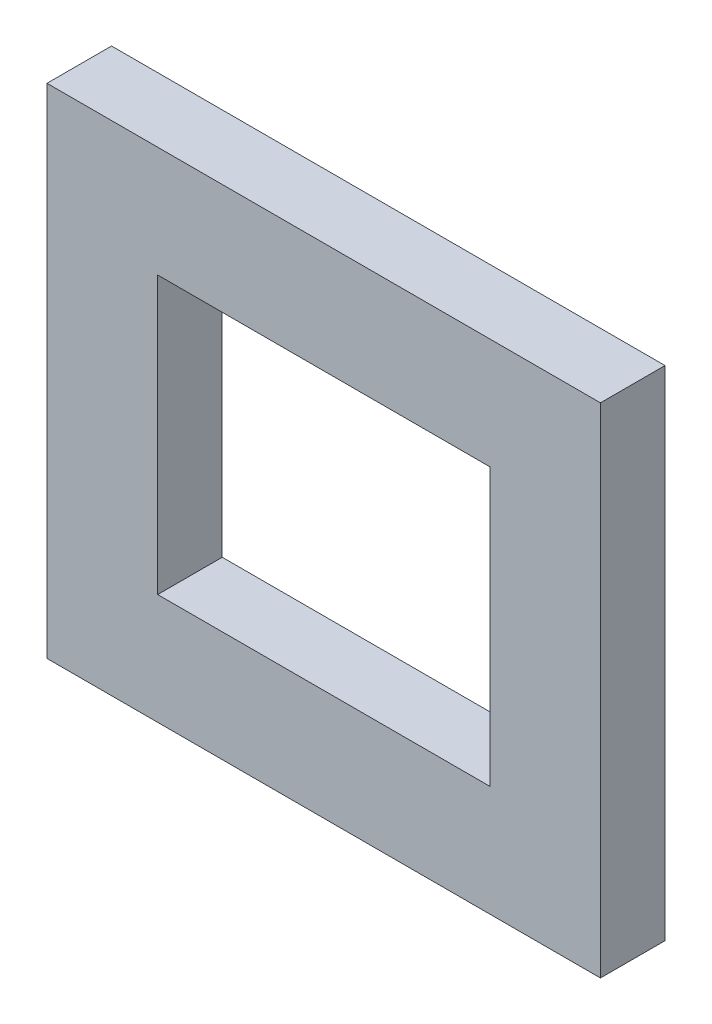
from build123d import *

# Parameters (mm, degrees)
SKETCH1_W           = 190.5
SKETCH1_H           = 171.45
SKETCH1_W_2         = 114.3
SKETCH1_H_2         = 95.25
BOSS_EXTRUDE1_DEPTH = 22.225


with BuildPart() as part:
    # Sketch1 → Boss-Extrude1 (new body)
    with BuildSketch(Plane.XY):
        Rectangle(SKETCH1_W, SKETCH1_H)
        Rectangle(SKETCH1_W_2, SKETCH1_H_2, mode=Mode.SUBTRACT)
    extrude(amount=BOSS_EXTRUDE1_DEPTH)


solid = part.part
